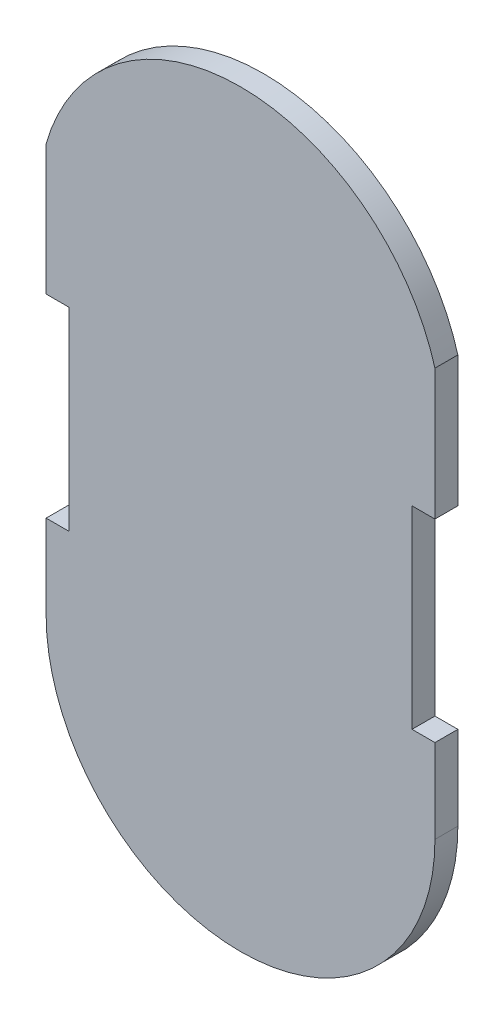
from build123d import *

# Parameters (mm, degrees)
BOSS_EXTRUDE1_DEPTH = 1.524


with BuildPart() as part:
    # Sketch1 → Boss-Extrude1 (new body)
    with BuildSketch(Plane.XY):
        with BuildLine():
            Line((0.20600674, -36.518142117), (0.20600674, -42.090079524))
            ThreePointArc((0.20600674, -42.090079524), (13.128729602, -55.012802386), (26.051452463, -42.090079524))
            Line((26.051452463, -42.090079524), (26.051452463, -36.515385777))
            Line((26.051452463, -36.515385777), (24.527452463, -36.515385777))
            Line((24.527452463, -36.515385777), (24.527452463, -23.650430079))
            Line((24.527452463, -23.650430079), (26.051452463, -23.650430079))
            Line((26.051452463, -23.650430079), (26.051452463, -14.962801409))
            ThreePointArc((26.051452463, -14.962801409), (13.128729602, -5.225437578), (0.20600674, -14.962801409))
            Line((0.20600674, -14.962801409), (0.20600674, -23.621187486))
            Line((0.20600674, -23.621187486), (1.725287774, -23.621187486))
            Line((1.725287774, -23.621187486), (1.725287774, -36.518142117))
            Line((1.725287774, -36.518142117), (0.20600674, -36.518142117))
        make_face()
    extrude(amount=BOSS_EXTRUDE1_DEPTH)


solid = part.part
